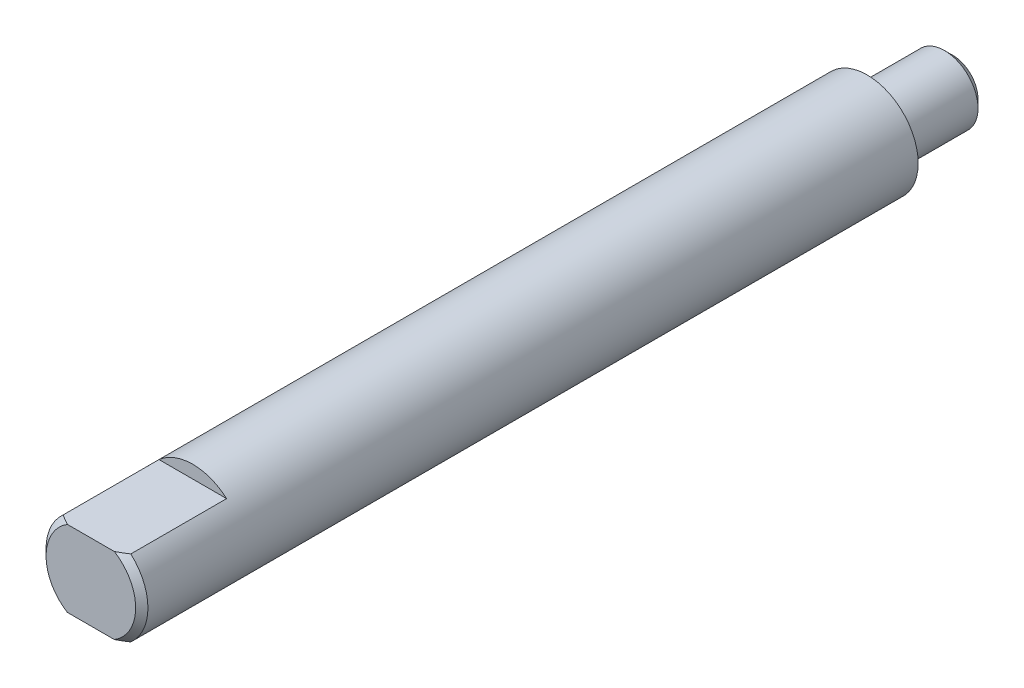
from build123d import *

# Parameters (mm, degrees)
SKETCH2_W          = 6.35
SKETCH2_H          = 0.8
CUT_EXTRUDE1_DEPTH = 5


with BuildPart() as part:
    # Sketch1 → Revolve1 (revolve)
    with BuildSketch(Plane(origin=(0, 0, 0), x_dir=(0, 0, -1), z_dir=(1, 0, 0)), mode=Mode.PRIVATE) as revolve1_sk:
        Polygon((49.6276, 1.5728), (49.1176, 2.0828), (44.2976, 2.0828), (44.2976, 3.175), (-3.684, 3.175), (-4.064, 2.79), (-4.064, 0), (49.6276, 0), align=None)
    revolve(revolve1_sk.sketch.rotate(Axis((0, 0, 4.064), (0, 0, -1)), 90), axis=Axis((0, 0, 4.064), (0, 0, -1)))

    # Sketch2 → Cut-Extrude1 (cut, symmetric)
    with BuildSketch(Plane(origin=(0, 0, 0), x_dir=(0, 0, -1), z_dir=(1, 0, 0))):
        with Locations((-0.889, 2.775)):
            Rectangle(SKETCH2_W, SKETCH2_H)
        with Locations((-0.889, -2.775)):
            Rectangle(SKETCH2_W, SKETCH2_H)
    extrude(amount=CUT_EXTRUDE1_DEPTH, both=True, mode=Mode.SUBTRACT)


solid = part.part
